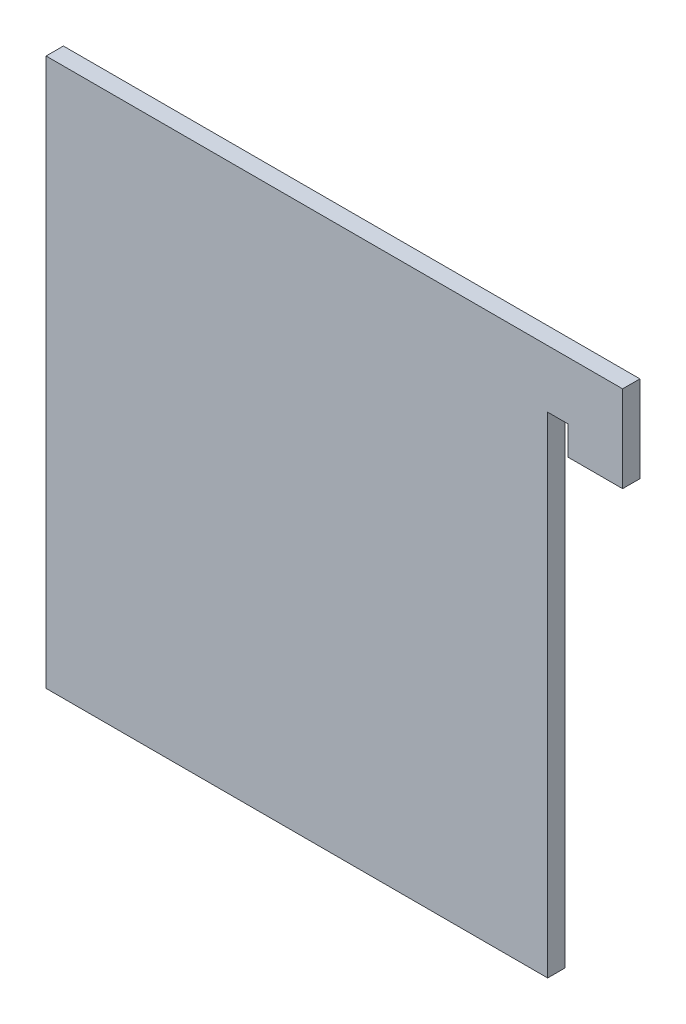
ISO-10303-21;
HEADER;
FILE_DESCRIPTION(('STEP AP214'),'2;1');
FILE_NAME('part.step','',(''),(''),'','','');
FILE_SCHEMA(('AUTOMOTIVE_DESIGN { 1 0 10303 214 1 1 1 1 }'));
ENDSEC;
DATA;
#1=APPLICATION_CONTEXT('core data for automotive mechanical design processes');
#2=APPLICATION_PROTOCOL_DEFINITION('international standard','automotive_design',2000,#1);
#3=PRODUCT_CONTEXT('',#1,'mechanical');
#4=PRODUCT('Part','Part','',(#3));
#5=PRODUCT_RELATED_PRODUCT_CATEGORY('part','',(#4));
#6=PRODUCT_DEFINITION_FORMATION('','',#4);
#7=PRODUCT_DEFINITION_CONTEXT('part definition',#1,'design');
#8=PRODUCT_DEFINITION('design','',#6,#7);
#9=PRODUCT_DEFINITION_SHAPE('','',#8);
#10=(LENGTH_UNIT() NAMED_UNIT(*) SI_UNIT(.MILLI.,.METRE.));
#11=(NAMED_UNIT(*) PLANE_ANGLE_UNIT() SI_UNIT($,.RADIAN.));
#12=(NAMED_UNIT(*) SI_UNIT($,.STERADIAN.) SOLID_ANGLE_UNIT());
#13=UNCERTAINTY_MEASURE_WITH_UNIT(LENGTH_MEASURE(1.E-05),#10,'distance_accuracy_value','');
#14=(GEOMETRIC_REPRESENTATION_CONTEXT(3) GLOBAL_UNCERTAINTY_ASSIGNED_CONTEXT((#13)) GLOBAL_UNIT_ASSIGNED_CONTEXT((#10,
#11,#12)) REPRESENTATION_CONTEXT('',''));
#15=CARTESIAN_POINT('',(0.,0.,0.));
#16=DIRECTION('',(0.,0.,1.));
#17=DIRECTION('',(1.,0.,0.));
#18=AXIS2_PLACEMENT_3D('',#15,#16,#17);
#19=CARTESIAN_POINT('',(0.,0.,3.));
#20=DIRECTION('',(1.,0.,0.));
#21=DIRECTION('',(0.,0.,-1.));
#22=AXIS2_PLACEMENT_3D('',#19,#20,#21);
#23=PLANE('',#22);
#24=DIRECTION('',(0.,-1.,0.));
#25=VECTOR('',#24,1.);
#26=CARTESIAN_POINT('',(0.,0.,0.));
#27=LINE('',#26,#25);
#28=CARTESIAN_POINT('',(0.,95.,0.));
#29=VERTEX_POINT('',#28);
#30=CARTESIAN_POINT('',(0.,0.,0.));
#31=VERTEX_POINT('',#30);
#32=EDGE_CURVE('E144',#29,#31,#27,.T.);
#33=ORIENTED_EDGE('',*,*,#32,.T.);
#34=DIRECTION('',(0.,0.,-1.));
#35=VECTOR('',#34,1.);
#36=CARTESIAN_POINT('',(0.,0.,3.));
#37=LINE('',#36,#35);
#38=CARTESIAN_POINT('',(0.,0.,3.));
#39=VERTEX_POINT('',#38);
#40=EDGE_CURVE('E11',#39,#31,#37,.T.);
#41=ORIENTED_EDGE('',*,*,#40,.F.);
#42=DIRECTION('',(0.,-1.,0.));
#43=VECTOR('',#42,1.);
#44=CARTESIAN_POINT('',(0.,0.,3.));
#45=LINE('',#44,#43);
#46=CARTESIAN_POINT('',(0.,95.,3.));
#47=VERTEX_POINT('',#46);
#48=EDGE_CURVE('E146',#47,#39,#45,.T.);
#49=ORIENTED_EDGE('',*,*,#48,.F.);
#50=DIRECTION('',(0.,0.,-1.));
#51=VECTOR('',#50,1.);
#52=CARTESIAN_POINT('',(0.,95.,3.));
#53=LINE('',#52,#51);
#54=EDGE_CURVE('E152',#47,#29,#53,.T.);
#55=ORIENTED_EDGE('',*,*,#54,.T.);
#56=EDGE_LOOP('',(#33,#41,#49,#55));
#57=FACE_BOUND('',#56,.T.);
#58=ADVANCED_FACE('F31',(#57),#23,.F.);
#59=CARTESIAN_POINT('',(0.,0.,3.));
#60=DIRECTION('',(0.,1.,0.));
#61=DIRECTION('',(0.,0.,1.));
#62=AXIS2_PLACEMENT_3D('',#59,#60,#61);
#63=PLANE('',#62);
#64=DIRECTION('',(1.,0.,0.));
#65=VECTOR('',#64,1.);
#66=CARTESIAN_POINT('',(0.,0.,0.));
#67=LINE('',#66,#65);
#68=CARTESIAN_POINT('',(87.,0.,0.));
#69=VERTEX_POINT('',#68);
#70=EDGE_CURVE('E155',#31,#69,#67,.T.);
#71=ORIENTED_EDGE('',*,*,#70,.T.);
#72=DIRECTION('',(0.,0.,1.));
#73=VECTOR('',#72,1.);
#74=CARTESIAN_POINT('',(87.,0.,0.));
#75=LINE('',#74,#73);
#76=CARTESIAN_POINT('',(87.,0.,3.));
#77=VERTEX_POINT('',#76);
#78=EDGE_CURVE('E142',#69,#77,#75,.T.);
#79=ORIENTED_EDGE('',*,*,#78,.T.);
#80=DIRECTION('',(1.,0.,0.));
#81=VECTOR('',#80,1.);
#82=CARTESIAN_POINT('',(0.,0.,3.));
#83=LINE('',#82,#81);
#84=EDGE_CURVE('E77',#39,#77,#83,.T.);
#85=ORIENTED_EDGE('',*,*,#84,.F.);
#86=ORIENTED_EDGE('',*,*,#40,.T.);
#87=EDGE_LOOP('',(#71,#79,#85,#86));
#88=FACE_BOUND('',#87,.T.);
#89=ADVANCED_FACE('F172',(#88),#63,.F.);
#90=CARTESIAN_POINT('',(100.,0.,3.));
#91=DIRECTION('',(-1.,0.,0.));
#92=DIRECTION('',(0.,0.,1.));
#93=AXIS2_PLACEMENT_3D('',#90,#91,#92);
#94=PLANE('',#93);
#95=DIRECTION('',(0.,1.,0.));
#96=VECTOR('',#95,1.);
#97=CARTESIAN_POINT('',(100.,0.,3.));
#98=LINE('',#97,#96);
#99=CARTESIAN_POINT('',(100.,80.,3.));
#100=VERTEX_POINT('',#99);
#101=CARTESIAN_POINT('',(100.,95.,3.));
#102=VERTEX_POINT('',#101);
#103=EDGE_CURVE('E149',#100,#102,#98,.T.);
#104=ORIENTED_EDGE('',*,*,#103,.F.);
#105=DIRECTION('',(0.,0.,1.));
#106=VECTOR('',#105,1.);
#107=CARTESIAN_POINT('',(100.,80.,0.));
#108=LINE('',#107,#106);
#109=CARTESIAN_POINT('',(100.,80.,0.));
#110=VERTEX_POINT('',#109);
#111=EDGE_CURVE('E138',#110,#100,#108,.T.);
#112=ORIENTED_EDGE('',*,*,#111,.F.);
#113=DIRECTION('',(0.,1.,0.));
#114=VECTOR('',#113,1.);
#115=CARTESIAN_POINT('',(100.,0.,0.));
#116=LINE('',#115,#114);
#117=CARTESIAN_POINT('',(100.,95.,0.));
#118=VERTEX_POINT('',#117);
#119=EDGE_CURVE('E158',#110,#118,#116,.T.);
#120=ORIENTED_EDGE('',*,*,#119,.T.);
#121=DIRECTION('',(0.,0.,-1.));
#122=VECTOR('',#121,1.);
#123=CARTESIAN_POINT('',(100.,95.,3.));
#124=LINE('',#123,#122);
#125=EDGE_CURVE('E38',#102,#118,#124,.T.);
#126=ORIENTED_EDGE('',*,*,#125,.F.);
#127=EDGE_LOOP('',(#104,#112,#120,#126));
#128=FACE_BOUND('',#127,.T.);
#129=ADVANCED_FACE('F174',(#128),#94,.F.);
#130=CARTESIAN_POINT('',(0.,95.,3.));
#131=DIRECTION('',(0.,-1.,0.));
#132=DIRECTION('',(0.,0.,-1.));
#133=AXIS2_PLACEMENT_3D('',#130,#131,#132);
#134=PLANE('',#133);
#135=DIRECTION('',(-1.,0.,0.));
#136=VECTOR('',#135,1.);
#137=CARTESIAN_POINT('',(0.,95.,0.));
#138=LINE('',#137,#136);
#139=EDGE_CURVE('E71',#118,#29,#138,.T.);
#140=ORIENTED_EDGE('',*,*,#139,.T.);
#141=ORIENTED_EDGE('',*,*,#54,.F.);
#142=DIRECTION('',(-1.,0.,0.));
#143=VECTOR('',#142,1.);
#144=CARTESIAN_POINT('',(0.,95.,3.));
#145=LINE('',#144,#143);
#146=EDGE_CURVE('E54',#102,#47,#145,.T.);
#147=ORIENTED_EDGE('',*,*,#146,.F.);
#148=ORIENTED_EDGE('',*,*,#125,.T.);
#149=EDGE_LOOP('',(#140,#141,#147,#148));
#150=FACE_BOUND('',#149,.T.);
#151=ADVANCED_FACE('F162',(#150),#134,.F.);
#152=CARTESIAN_POINT('',(0.,95.,3.));
#153=DIRECTION('',(0.,0.,-1.));
#154=DIRECTION('',(-1.,0.,0.));
#155=AXIS2_PLACEMENT_3D('',#152,#153,#154);
#156=PLANE('',#155);
#157=DIRECTION('',(0.,-1.,0.));
#158=VECTOR('',#157,1.);
#159=CARTESIAN_POINT('',(87.,0.,3.));
#160=LINE('',#159,#158);
#161=CARTESIAN_POINT('',(87.,85.,3.));
#162=VERTEX_POINT('',#161);
#163=EDGE_CURVE('E136',#162,#77,#160,.T.);
#164=ORIENTED_EDGE('',*,*,#163,.F.);
#165=DIRECTION('',(-1.,0.,0.));
#166=VECTOR('',#165,1.);
#167=CARTESIAN_POINT('',(87.,85.,3.));
#168=LINE('',#167,#166);
#169=CARTESIAN_POINT('',(90.5,85.,3.));
#170=VERTEX_POINT('',#169);
#171=EDGE_CURVE('E126',#170,#162,#168,.T.);
#172=ORIENTED_EDGE('',*,*,#171,.F.);
#173=DIRECTION('',(0.,1.,0.));
#174=VECTOR('',#173,1.);
#175=CARTESIAN_POINT('',(90.5,80.,3.));
#176=LINE('',#175,#174);
#177=CARTESIAN_POINT('',(90.5,80.,3.));
#178=VERTEX_POINT('',#177);
#179=EDGE_CURVE('E107',#178,#170,#176,.T.);
#180=ORIENTED_EDGE('',*,*,#179,.F.);
#181=DIRECTION('',(-1.,0.,0.));
#182=VECTOR('',#181,1.);
#183=CARTESIAN_POINT('',(100.,80.,3.));
#184=LINE('',#183,#182);
#185=EDGE_CURVE('E131',#100,#178,#184,.T.);
#186=ORIENTED_EDGE('',*,*,#185,.F.);
#187=ORIENTED_EDGE('',*,*,#103,.T.);
#188=ORIENTED_EDGE('',*,*,#146,.T.);
#189=ORIENTED_EDGE('',*,*,#48,.T.);
#190=ORIENTED_EDGE('',*,*,#84,.T.);
#191=EDGE_LOOP('',(#164,#172,#180,#186,#187,#188,#189,#190));
#192=FACE_BOUND('',#191,.T.);
#193=ADVANCED_FACE('F169',(#192),#156,.F.);
#194=CARTESIAN_POINT('',(0.,95.,0.));
#195=DIRECTION('',(0.,0.,-1.));
#196=DIRECTION('',(-1.,0.,0.));
#197=AXIS2_PLACEMENT_3D('',#194,#195,#196);
#198=PLANE('',#197);
#199=DIRECTION('',(-1.,0.,0.));
#200=VECTOR('',#199,1.);
#201=CARTESIAN_POINT('',(87.,85.,0.));
#202=LINE('',#201,#200);
#203=CARTESIAN_POINT('',(90.5,85.,0.));
#204=VERTEX_POINT('',#203);
#205=CARTESIAN_POINT('',(87.,85.,0.));
#206=VERTEX_POINT('',#205);
#207=EDGE_CURVE('E116',#204,#206,#202,.T.);
#208=ORIENTED_EDGE('',*,*,#207,.T.);
#209=DIRECTION('',(0.,-1.,0.));
#210=VECTOR('',#209,1.);
#211=CARTESIAN_POINT('',(87.,0.,0.));
#212=LINE('',#211,#210);
#213=EDGE_CURVE('E135',#206,#69,#212,.T.);
#214=ORIENTED_EDGE('',*,*,#213,.T.);
#215=ORIENTED_EDGE('',*,*,#70,.F.);
#216=ORIENTED_EDGE('',*,*,#32,.F.);
#217=ORIENTED_EDGE('',*,*,#139,.F.);
#218=ORIENTED_EDGE('',*,*,#119,.F.);
#219=DIRECTION('',(-1.,0.,0.));
#220=VECTOR('',#219,1.);
#221=CARTESIAN_POINT('',(100.,80.,0.));
#222=LINE('',#221,#220);
#223=CARTESIAN_POINT('',(90.5,80.,0.));
#224=VERTEX_POINT('',#223);
#225=EDGE_CURVE('E125',#110,#224,#222,.T.);
#226=ORIENTED_EDGE('',*,*,#225,.T.);
#227=DIRECTION('',(0.,1.,0.));
#228=VECTOR('',#227,1.);
#229=CARTESIAN_POINT('',(90.5,80.,0.));
#230=LINE('',#229,#228);
#231=EDGE_CURVE('E45',#224,#204,#230,.T.);
#232=ORIENTED_EDGE('',*,*,#231,.T.);
#233=EDGE_LOOP('',(#208,#214,#215,#216,#217,#218,#226,#232));
#234=FACE_BOUND('',#233,.T.);
#235=ADVANCED_FACE('F123',(#234),#198,.T.);
#236=CARTESIAN_POINT('',(87.,0.,0.));
#237=DIRECTION('',(-1.,0.,0.));
#238=DIRECTION('',(0.,0.,1.));
#239=AXIS2_PLACEMENT_3D('',#236,#237,#238);
#240=PLANE('',#239);
#241=ORIENTED_EDGE('',*,*,#163,.T.);
#242=ORIENTED_EDGE('',*,*,#78,.F.);
#243=ORIENTED_EDGE('',*,*,#213,.F.);
#244=DIRECTION('',(0.,0.,1.));
#245=VECTOR('',#244,1.);
#246=CARTESIAN_POINT('',(87.,85.,0.));
#247=LINE('',#246,#245);
#248=EDGE_CURVE('E111',#206,#162,#247,.T.);
#249=ORIENTED_EDGE('',*,*,#248,.T.);
#250=EDGE_LOOP('',(#241,#242,#243,#249));
#251=FACE_BOUND('',#250,.T.);
#252=ADVANCED_FACE('F171',(#251),#240,.F.);
#253=CARTESIAN_POINT('',(100.,80.,0.));
#254=DIRECTION('',(0.,1.,0.));
#255=DIRECTION('',(0.,0.,1.));
#256=AXIS2_PLACEMENT_3D('',#253,#254,#255);
#257=PLANE('',#256);
#258=ORIENTED_EDGE('',*,*,#185,.T.);
#259=DIRECTION('',(0.,0.,1.));
#260=VECTOR('',#259,1.);
#261=CARTESIAN_POINT('',(90.5,80.,0.));
#262=LINE('',#261,#260);
#263=EDGE_CURVE('E112',#224,#178,#262,.T.);
#264=ORIENTED_EDGE('',*,*,#263,.F.);
#265=ORIENTED_EDGE('',*,*,#225,.F.);
#266=ORIENTED_EDGE('',*,*,#111,.T.);
#267=EDGE_LOOP('',(#258,#264,#265,#266));
#268=FACE_BOUND('',#267,.T.);
#269=ADVANCED_FACE('F187',(#268),#257,.F.);
#270=CARTESIAN_POINT('',(87.,85.,0.));
#271=DIRECTION('',(0.,1.,0.));
#272=DIRECTION('',(0.,0.,1.));
#273=AXIS2_PLACEMENT_3D('',#270,#271,#272);
#274=PLANE('',#273);
#275=ORIENTED_EDGE('',*,*,#171,.T.);
#276=ORIENTED_EDGE('',*,*,#248,.F.);
#277=ORIENTED_EDGE('',*,*,#207,.F.);
#278=DIRECTION('',(0.,0.,1.));
#279=VECTOR('',#278,1.);
#280=CARTESIAN_POINT('',(90.5,85.,0.));
#281=LINE('',#280,#279);
#282=EDGE_CURVE('E103',#204,#170,#281,.T.);
#283=ORIENTED_EDGE('',*,*,#282,.T.);
#284=EDGE_LOOP('',(#275,#276,#277,#283));
#285=FACE_BOUND('',#284,.T.);
#286=ADVANCED_FACE('F117',(#285),#274,.F.);
#287=CARTESIAN_POINT('',(90.5,80.,0.));
#288=DIRECTION('',(1.,0.,0.));
#289=DIRECTION('',(0.,0.,-1.));
#290=AXIS2_PLACEMENT_3D('',#287,#288,#289);
#291=PLANE('',#290);
#292=ORIENTED_EDGE('',*,*,#179,.T.);
#293=ORIENTED_EDGE('',*,*,#282,.F.);
#294=ORIENTED_EDGE('',*,*,#231,.F.);
#295=ORIENTED_EDGE('',*,*,#263,.T.);
#296=EDGE_LOOP('',(#292,#293,#294,#295));
#297=FACE_BOUND('',#296,.T.);
#298=ADVANCED_FACE('F105',(#297),#291,.F.);
#299=CLOSED_SHELL('',(#58,#89,#129,#151,#193,#235,#252,#269,#286,#298));
#300=MANIFOLD_SOLID_BREP('B2',#299);
#301=ADVANCED_BREP_SHAPE_REPRESENTATION('',(#18,#300),#14);
#302=SHAPE_DEFINITION_REPRESENTATION(#9,#301);
ENDSEC;
END-ISO-10303-21;
